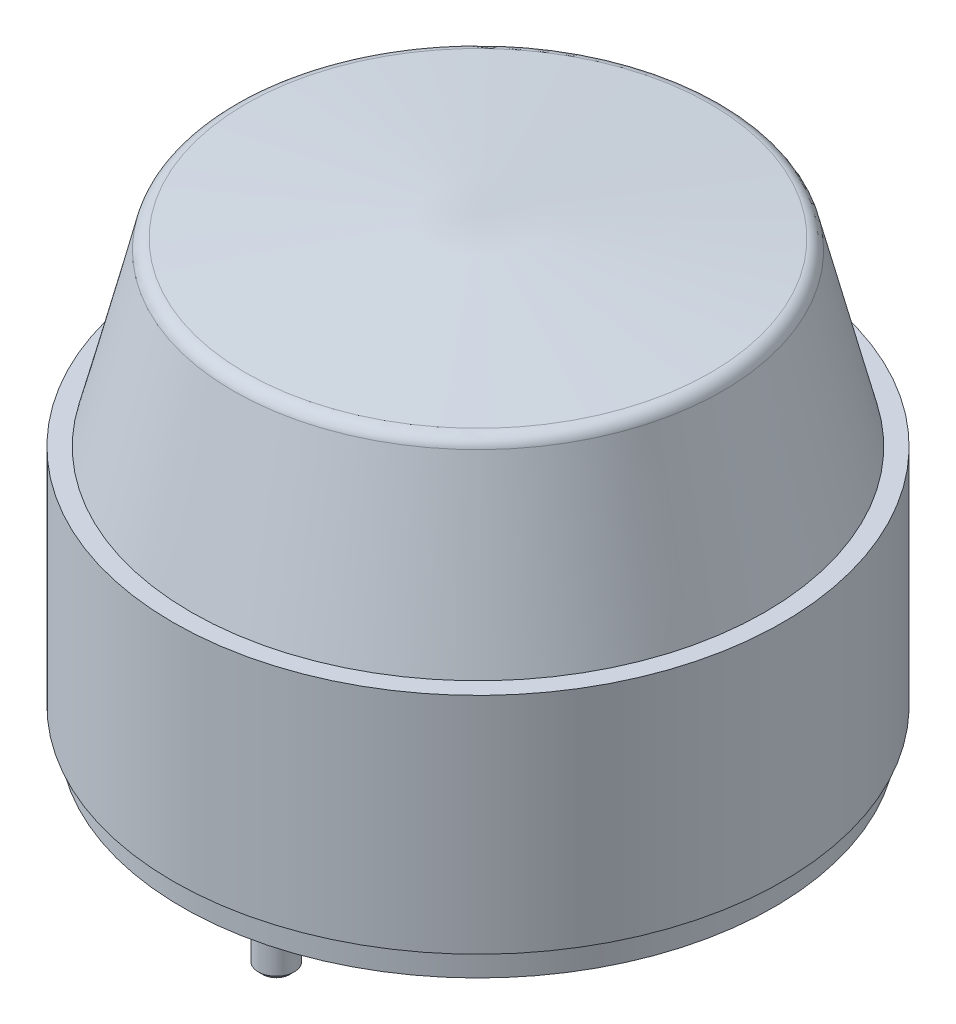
ISO-10303-21;
HEADER;
FILE_DESCRIPTION(('STEP AP214'),'2;1');
FILE_NAME('part.step','',(''),(''),'','','');
FILE_SCHEMA(('AUTOMOTIVE_DESIGN { 1 0 10303 214 1 1 1 1 }'));
ENDSEC;
DATA;
#1=APPLICATION_CONTEXT('core data for automotive mechanical design processes');
#2=APPLICATION_PROTOCOL_DEFINITION('international standard','automotive_design',2000,#1);
#3=PRODUCT_CONTEXT('',#1,'mechanical');
#4=PRODUCT('Part','Part','',(#3));
#5=PRODUCT_RELATED_PRODUCT_CATEGORY('part','',(#4));
#6=PRODUCT_DEFINITION_FORMATION('','',#4);
#7=PRODUCT_DEFINITION_CONTEXT('part definition',#1,'design');
#8=PRODUCT_DEFINITION('design','',#6,#7);
#9=PRODUCT_DEFINITION_SHAPE('','',#8);
#10=(LENGTH_UNIT() NAMED_UNIT(*) SI_UNIT(.MILLI.,.METRE.));
#11=(NAMED_UNIT(*) PLANE_ANGLE_UNIT() SI_UNIT($,.RADIAN.));
#12=(NAMED_UNIT(*) SI_UNIT($,.STERADIAN.) SOLID_ANGLE_UNIT());
#13=UNCERTAINTY_MEASURE_WITH_UNIT(LENGTH_MEASURE(1.E-05),#10,'distance_accuracy_value','');
#14=(GEOMETRIC_REPRESENTATION_CONTEXT(3) GLOBAL_UNCERTAINTY_ASSIGNED_CONTEXT((#13)) GLOBAL_UNIT_ASSIGNED_CONTEXT((#10,
#11,#12)) REPRESENTATION_CONTEXT('',''));
#15=CARTESIAN_POINT('',(0.,0.,0.));
#16=DIRECTION('',(0.,0.,1.));
#17=DIRECTION('',(1.,0.,0.));
#18=AXIS2_PLACEMENT_3D('',#15,#16,#17);
#19=CARTESIAN_POINT('',(0.,0.,0.));
#20=DIRECTION('',(0.,-1.,0.));
#21=DIRECTION('',(0.,0.,-1.));
#22=AXIS2_PLACEMENT_3D('',#19,#20,#21);
#23=PLANE('',#22);
#24=CARTESIAN_POINT('',(0.,0.,0.));
#25=DIRECTION('',(0.,-1.,0.));
#26=DIRECTION('',(0.,0.,-1.));
#27=AXIS2_PLACEMENT_3D('',#24,#25,#26);
#28=CIRCLE('',#27,10.);
#29=CARTESIAN_POINT('',(0.,0.,-10.));
#30=VERTEX_POINT('',#29);
#31=EDGE_CURVE('E151',#30,#30,#28,.T.);
#32=ORIENTED_EDGE('',*,*,#31,.F.);
#33=EDGE_LOOP('',(#32));
#34=FACE_BOUND('',#33,.T.);
#35=CARTESIAN_POINT('',(0.,0.,22.5));
#36=DIRECTION('',(0.,-1.,0.));
#37=DIRECTION('',(0.,0.,-1.));
#38=AXIS2_PLACEMENT_3D('',#35,#36,#37);
#39=CIRCLE('',#38,2.);
#40=CARTESIAN_POINT('',(0.,0.,20.5));
#41=VERTEX_POINT('',#40);
#42=EDGE_CURVE('E142',#41,#41,#39,.T.);
#43=ORIENTED_EDGE('',*,*,#42,.F.);
#44=EDGE_LOOP('',(#43));
#45=FACE_BOUND('',#44,.T.);
#46=CARTESIAN_POINT('',(0.,0.,0.));
#47=DIRECTION('',(0.,-1.,0.));
#48=DIRECTION('',(0.,0.,-1.));
#49=AXIS2_PLACEMENT_3D('',#46,#47,#48);
#50=CIRCLE('',#49,33.);
#51=CARTESIAN_POINT('',(0.,0.,-33.));
#52=VERTEX_POINT('',#51);
#53=EDGE_CURVE('E139',#52,#52,#50,.T.);
#54=ORIENTED_EDGE('',*,*,#53,.T.);
#55=EDGE_LOOP('',(#54));
#56=FACE_BOUND('',#55,.T.);
#57=CARTESIAN_POINT('',(0.,0.,-22.5));
#58=DIRECTION('',(0.,-1.,0.));
#59=DIRECTION('',(0.,0.,-1.));
#60=AXIS2_PLACEMENT_3D('',#57,#58,#59);
#61=CIRCLE('',#60,2.);
#62=CARTESIAN_POINT('',(0.,0.,-24.5));
#63=VERTEX_POINT('',#62);
#64=EDGE_CURVE('E145',#63,#63,#61,.T.);
#65=ORIENTED_EDGE('',*,*,#64,.F.);
#66=EDGE_LOOP('',(#65));
#67=FACE_BOUND('',#66,.T.);
#68=ADVANCED_FACE('F30',(#34,#45,#56,#67),#23,.T.);
#69=CARTESIAN_POINT('',(0.,48.,0.));
#70=DIRECTION('',(0.,-1.,0.));
#71=DIRECTION('',(0.,0.,-1.));
#72=AXIS2_PLACEMENT_3D('',#69,#70,#71);
#73=CONICAL_SURFACE('',#72,27.,1.4784669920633);
#74=CARTESIAN_POINT('',(0.,48.0980535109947,0.));
#75=DIRECTION('',(0.,1.,0.));
#76=DIRECTION('',(0.,0.,1.));
#77=AXIS2_PLACEMENT_3D('',#74,#75,#76);
#78=CIRCLE('',#77,25.9410220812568);
#79=CARTESIAN_POINT('',(0.,48.0980535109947,25.9410220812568));
#80=VERTEX_POINT('',#79);
#81=EDGE_CURVE('E53',#80,#80,#78,.T.);
#82=ORIENTED_EDGE('',*,*,#81,.T.);
#83=EDGE_LOOP('',(#82));
#84=FACE_BOUND('',#83,.T.);
#85=CARTESIAN_POINT('',(0.,50.5,0.));
#86=VERTEX_POINT('',#85);
#87=VERTEX_LOOP('',#86);
#88=FACE_BOUND('',#87,.T.);
#89=ADVANCED_FACE('F32',(#84,#88),#73,.T.);
#90=CARTESIAN_POINT('',(0.,28.,0.));
#91=DIRECTION('',(0.,-1.,0.));
#92=DIRECTION('',(0.,0.,-1.));
#93=AXIS2_PLACEMENT_3D('',#90,#91,#92);
#94=CONICAL_SURFACE('',#93,32.,0.244978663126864);
#95=CARTESIAN_POINT('',(0.,46.9682459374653,0.));
#96=DIRECTION('',(0.,1.,0.));
#97=DIRECTION('',(0.,0.,1.));
#98=AXIS2_PLACEMENT_3D('',#95,#96,#97);
#99=CIRCLE('',#98,27.2579385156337);
#100=CARTESIAN_POINT('',(0.,46.9682459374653,27.2579385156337));
#101=VERTEX_POINT('',#100);
#102=EDGE_CURVE('E56',#101,#101,#99,.F.);
#103=ORIENTED_EDGE('',*,*,#102,.T.);
#104=EDGE_LOOP('',(#103));
#105=FACE_BOUND('',#104,.T.);
#106=CARTESIAN_POINT('',(0.,28.,0.));
#107=DIRECTION('',(0.,-1.,0.));
#108=DIRECTION('',(0.,0.,-1.));
#109=AXIS2_PLACEMENT_3D('',#106,#107,#108);
#110=CIRCLE('',#109,32.);
#111=CARTESIAN_POINT('',(0.,28.,-32.));
#112=VERTEX_POINT('',#111);
#113=EDGE_CURVE('E62',#112,#112,#110,.T.);
#114=ORIENTED_EDGE('',*,*,#113,.F.);
#115=EDGE_LOOP('',(#114));
#116=FACE_BOUND('',#115,.T.);
#117=ADVANCED_FACE('F41',(#105,#116),#94,.T.);
#118=CARTESIAN_POINT('',(34.,28.,0.));
#119=DIRECTION('',(0.,1.,0.));
#120=DIRECTION('',(0.,0.,1.));
#121=AXIS2_PLACEMENT_3D('',#118,#119,#120);
#122=PLANE('',#121);
#123=ORIENTED_EDGE('',*,*,#113,.T.);
#124=EDGE_LOOP('',(#123));
#125=FACE_BOUND('',#124,.T.);
#126=CARTESIAN_POINT('',(0.,28.,0.));
#127=DIRECTION('',(0.,-1.,0.));
#128=DIRECTION('',(0.,0.,-1.));
#129=AXIS2_PLACEMENT_3D('',#126,#127,#128);
#130=CIRCLE('',#129,34.);
#131=CARTESIAN_POINT('',(0.,28.,-34.));
#132=VERTEX_POINT('',#131);
#133=EDGE_CURVE('E130',#132,#132,#130,.T.);
#134=ORIENTED_EDGE('',*,*,#133,.F.);
#135=EDGE_LOOP('',(#134));
#136=FACE_BOUND('',#135,.T.);
#137=ADVANCED_FACE('F47',(#125,#136),#122,.T.);
#138=CARTESIAN_POINT('',(0.,0.,0.));
#139=DIRECTION('',(0.,-1.,0.));
#140=DIRECTION('',(0.,0.,-1.));
#141=AXIS2_PLACEMENT_3D('',#138,#139,#140);
#142=CYLINDRICAL_SURFACE('',#141,34.);
#143=ORIENTED_EDGE('',*,*,#133,.T.);
#144=EDGE_LOOP('',(#143));
#145=FACE_BOUND('',#144,.T.);
#146=CARTESIAN_POINT('',(0.,3.,0.));
#147=DIRECTION('',(0.,-1.,0.));
#148=DIRECTION('',(0.,0.,-1.));
#149=AXIS2_PLACEMENT_3D('',#146,#147,#148);
#150=CIRCLE('',#149,34.);
#151=CARTESIAN_POINT('',(0.,3.,-34.));
#152=VERTEX_POINT('',#151);
#153=EDGE_CURVE('E131',#152,#152,#150,.T.);
#154=ORIENTED_EDGE('',*,*,#153,.F.);
#155=EDGE_LOOP('',(#154));
#156=FACE_BOUND('',#155,.T.);
#157=ADVANCED_FACE('F116',(#145,#156),#142,.T.);
#158=CARTESIAN_POINT('',(34.,3.,0.));
#159=DIRECTION('',(0.,-1.,0.));
#160=DIRECTION('',(0.,0.,-1.));
#161=AXIS2_PLACEMENT_3D('',#158,#159,#160);
#162=PLANE('',#161);
#163=ORIENTED_EDGE('',*,*,#153,.T.);
#164=EDGE_LOOP('',(#163));
#165=FACE_BOUND('',#164,.T.);
#166=CARTESIAN_POINT('',(0.,3.,0.));
#167=DIRECTION('',(0.,-1.,0.));
#168=DIRECTION('',(0.,0.,-1.));
#169=AXIS2_PLACEMENT_3D('',#166,#167,#168);
#170=CIRCLE('',#169,33.);
#171=CARTESIAN_POINT('',(0.,3.,-33.));
#172=VERTEX_POINT('',#171);
#173=EDGE_CURVE('E134',#172,#172,#170,.T.);
#174=ORIENTED_EDGE('',*,*,#173,.F.);
#175=EDGE_LOOP('',(#174));
#176=FACE_BOUND('',#175,.T.);
#177=ADVANCED_FACE('F112',(#165,#176),#162,.T.);
#178=CARTESIAN_POINT('',(0.,0.,0.));
#179=DIRECTION('',(0.,-1.,0.));
#180=DIRECTION('',(0.,0.,-1.));
#181=AXIS2_PLACEMENT_3D('',#178,#179,#180);
#182=CYLINDRICAL_SURFACE('',#181,33.);
#183=ORIENTED_EDGE('',*,*,#173,.T.);
#184=EDGE_LOOP('',(#183));
#185=FACE_BOUND('',#184,.T.);
#186=ORIENTED_EDGE('',*,*,#53,.F.);
#187=EDGE_LOOP('',(#186));
#188=FACE_BOUND('',#187,.T.);
#189=ADVANCED_FACE('F108',(#185,#188),#182,.T.);
#190=CARTESIAN_POINT('',(0.,46.6044424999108,0.));
#191=DIRECTION('',(0.,1.,0.));
#192=DIRECTION('',(0.,0.,1.));
#193=AXIS2_PLACEMENT_3D('',#190,#191,#192);
#194=TOROIDAL_SURFACE('',#193,25.8027247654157,1.5);
#195=ORIENTED_EDGE('',*,*,#81,.F.);
#196=EDGE_LOOP('',(#195));
#197=FACE_BOUND('',#196,.T.);
#198=ORIENTED_EDGE('',*,*,#102,.F.);
#199=EDGE_LOOP('',(#198));
#200=FACE_BOUND('',#199,.T.);
#201=ADVANCED_FACE('F105',(#197,#200),#194,.T.);
#202=CARTESIAN_POINT('',(0.,-11.,22.5));
#203=DIRECTION('',(0.,1.,0.));
#204=DIRECTION('',(0.,0.,1.));
#205=AXIS2_PLACEMENT_3D('',#202,#203,#204);
#206=CYLINDRICAL_SURFACE('',#205,2.);
#207=CARTESIAN_POINT('',(0.,-10.5,22.5));
#208=DIRECTION('',(0.,-1.,0.));
#209=DIRECTION('',(0.,0.,-1.));
#210=AXIS2_PLACEMENT_3D('',#207,#208,#209);
#211=CIRCLE('',#210,2.);
#212=CARTESIAN_POINT('',(0.,-10.5,20.5));
#213=VERTEX_POINT('',#212);
#214=EDGE_CURVE('E11',#213,#213,#211,.F.);
#215=ORIENTED_EDGE('',*,*,#214,.T.);
#216=EDGE_LOOP('',(#215));
#217=FACE_BOUND('',#216,.T.);
#218=ORIENTED_EDGE('',*,*,#42,.T.);
#219=EDGE_LOOP('',(#218));
#220=FACE_BOUND('',#219,.T.);
#221=ADVANCED_FACE('F102',(#217,#220),#206,.T.);
#222=CARTESIAN_POINT('',(0.,-11.,22.5));
#223=DIRECTION('',(0.,-1.,0.));
#224=DIRECTION('',(0.,0.,-1.));
#225=AXIS2_PLACEMENT_3D('',#222,#223,#224);
#226=PLANE('',#225);
#227=CARTESIAN_POINT('',(0.,-11.,22.5));
#228=DIRECTION('',(0.,-1.,0.));
#229=DIRECTION('',(0.,0.,-1.));
#230=AXIS2_PLACEMENT_3D('',#227,#228,#229);
#231=CIRCLE('',#230,1.5);
#232=CARTESIAN_POINT('',(0.,-11.,21.));
#233=VERTEX_POINT('',#232);
#234=EDGE_CURVE('E37',#233,#233,#231,.T.);
#235=ORIENTED_EDGE('',*,*,#234,.T.);
#236=EDGE_LOOP('',(#235));
#237=FACE_BOUND('',#236,.T.);
#238=ADVANCED_FACE('F70',(#237),#226,.T.);
#239=CARTESIAN_POINT('',(0.,-11.,-22.5));
#240=DIRECTION('',(0.,1.,0.));
#241=DIRECTION('',(0.,0.,1.));
#242=AXIS2_PLACEMENT_3D('',#239,#240,#241);
#243=CYLINDRICAL_SURFACE('',#242,2.);
#244=CARTESIAN_POINT('',(0.,-10.5,-22.5));
#245=DIRECTION('',(0.,-1.,0.));
#246=DIRECTION('',(0.,0.,-1.));
#247=AXIS2_PLACEMENT_3D('',#244,#245,#246);
#248=CIRCLE('',#247,2.);
#249=CARTESIAN_POINT('',(0.,-10.5,-24.5));
#250=VERTEX_POINT('',#249);
#251=EDGE_CURVE('E59',#250,#250,#248,.F.);
#252=ORIENTED_EDGE('',*,*,#251,.T.);
#253=EDGE_LOOP('',(#252));
#254=FACE_BOUND('',#253,.T.);
#255=ORIENTED_EDGE('',*,*,#64,.T.);
#256=EDGE_LOOP('',(#255));
#257=FACE_BOUND('',#256,.T.);
#258=ADVANCED_FACE('F95',(#254,#257),#243,.T.);
#259=CARTESIAN_POINT('',(0.,-11.,-22.5));
#260=DIRECTION('',(0.,-1.,0.));
#261=DIRECTION('',(0.,0.,-1.));
#262=AXIS2_PLACEMENT_3D('',#259,#260,#261);
#263=PLANE('',#262);
#264=CARTESIAN_POINT('',(0.,-11.,-22.5));
#265=DIRECTION('',(0.,-1.,0.));
#266=DIRECTION('',(0.,0.,-1.));
#267=AXIS2_PLACEMENT_3D('',#264,#265,#266);
#268=CIRCLE('',#267,1.5);
#269=CARTESIAN_POINT('',(0.,-11.,-24.));
#270=VERTEX_POINT('',#269);
#271=EDGE_CURVE('E55',#270,#270,#268,.T.);
#272=ORIENTED_EDGE('',*,*,#271,.T.);
#273=EDGE_LOOP('',(#272));
#274=FACE_BOUND('',#273,.T.);
#275=ADVANCED_FACE('F91',(#274),#263,.T.);
#276=CARTESIAN_POINT('',(0.,3.,0.));
#277=DIRECTION('',(0.,-1.,0.));
#278=DIRECTION('',(0.,0.,-1.));
#279=AXIS2_PLACEMENT_3D('',#276,#277,#278);
#280=CYLINDRICAL_SURFACE('',#279,10.);
#281=CARTESIAN_POINT('',(0.,3.,0.));
#282=DIRECTION('',(0.,-1.,0.));
#283=DIRECTION('',(0.,0.,-1.));
#284=AXIS2_PLACEMENT_3D('',#281,#282,#283);
#285=CIRCLE('',#284,10.);
#286=CARTESIAN_POINT('',(0.,3.,-10.));
#287=VERTEX_POINT('',#286);
#288=EDGE_CURVE('E148',#287,#287,#285,.T.);
#289=ORIENTED_EDGE('',*,*,#288,.F.);
#290=EDGE_LOOP('',(#289));
#291=FACE_BOUND('',#290,.T.);
#292=ORIENTED_EDGE('',*,*,#31,.T.);
#293=EDGE_LOOP('',(#292));
#294=FACE_BOUND('',#293,.T.);
#295=ADVANCED_FACE('F87',(#291,#294),#280,.F.);
#296=CARTESIAN_POINT('',(0.,3.,0.));
#297=DIRECTION('',(0.,-1.,0.));
#298=DIRECTION('',(0.,0.,-1.));
#299=AXIS2_PLACEMENT_3D('',#296,#297,#298);
#300=PLANE('',#299);
#301=ORIENTED_EDGE('',*,*,#288,.T.);
#302=EDGE_LOOP('',(#301));
#303=FACE_BOUND('',#302,.T.);
#304=ADVANCED_FACE('F80',(#303),#300,.T.);
#305=CARTESIAN_POINT('',(0.,-11.,-22.5));
#306=DIRECTION('',(0.,1.,0.));
#307=DIRECTION('',(0.,0.,1.));
#308=AXIS2_PLACEMENT_3D('',#305,#306,#307);
#309=CONICAL_SURFACE('',#308,1.5,0.785398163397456);
#310=ORIENTED_EDGE('',*,*,#251,.F.);
#311=EDGE_LOOP('',(#310));
#312=FACE_BOUND('',#311,.T.);
#313=ORIENTED_EDGE('',*,*,#271,.F.);
#314=EDGE_LOOP('',(#313));
#315=FACE_BOUND('',#314,.T.);
#316=ADVANCED_FACE('F74',(#312,#315),#309,.T.);
#317=CARTESIAN_POINT('',(0.,-11.,22.5));
#318=DIRECTION('',(0.,1.,0.));
#319=DIRECTION('',(0.,0.,1.));
#320=AXIS2_PLACEMENT_3D('',#317,#318,#319);
#321=CONICAL_SURFACE('',#320,1.5,0.785398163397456);
#322=ORIENTED_EDGE('',*,*,#214,.F.);
#323=EDGE_LOOP('',(#322));
#324=FACE_BOUND('',#323,.T.);
#325=ORIENTED_EDGE('',*,*,#234,.F.);
#326=EDGE_LOOP('',(#325));
#327=FACE_BOUND('',#326,.T.);
#328=ADVANCED_FACE('F72',(#324,#327),#321,.T.);
#329=CLOSED_SHELL('',(#68,#89,#117,#137,#157,#177,#189,#201,#221,#238,#258,#275,#295,#304,#316,#328));
#330=MANIFOLD_SOLID_BREP('B2',#329);
#331=ADVANCED_BREP_SHAPE_REPRESENTATION('',(#18,#330),#14);
#332=SHAPE_DEFINITION_REPRESENTATION(#9,#331);
ENDSEC;
END-ISO-10303-21;
